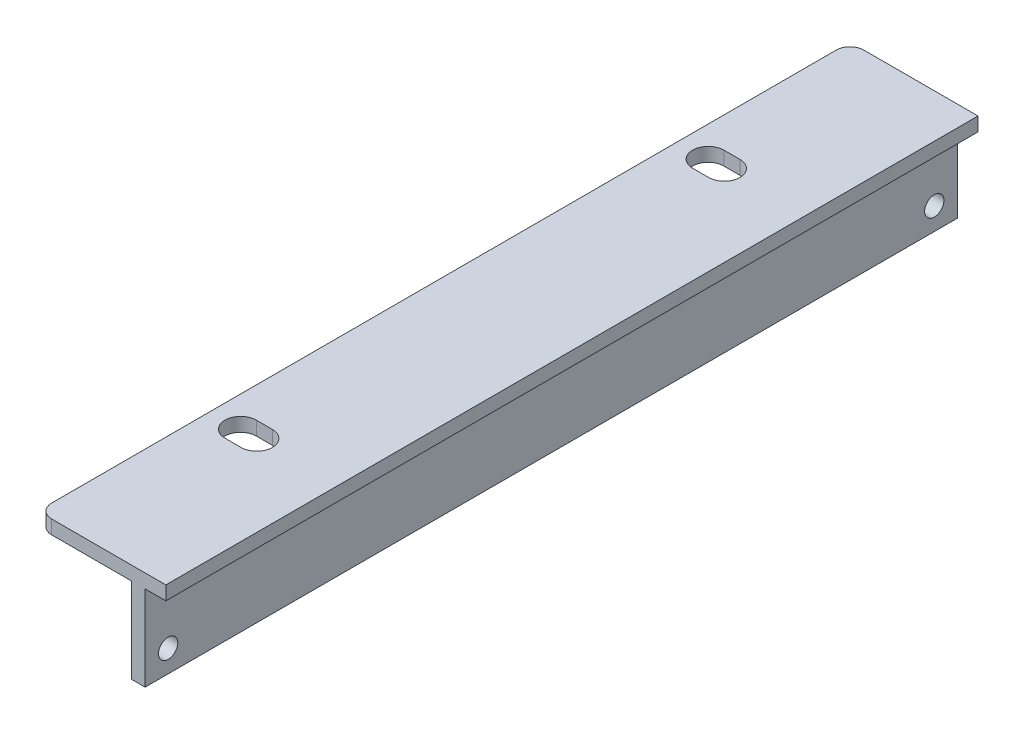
ISO-10303-21;
HEADER;
FILE_DESCRIPTION(('STEP AP214'),'2;1');
FILE_NAME('part.step','',(''),(''),'','','');
FILE_SCHEMA(('AUTOMOTIVE_DESIGN { 1 0 10303 214 1 1 1 1 }'));
ENDSEC;
DATA;
#1=APPLICATION_CONTEXT('core data for automotive mechanical design processes');
#2=APPLICATION_PROTOCOL_DEFINITION('international standard','automotive_design',2000,#1);
#3=PRODUCT_CONTEXT('',#1,'mechanical');
#4=PRODUCT('Part','Part','',(#3));
#5=PRODUCT_RELATED_PRODUCT_CATEGORY('part','',(#4));
#6=PRODUCT_DEFINITION_FORMATION('','',#4);
#7=PRODUCT_DEFINITION_CONTEXT('part definition',#1,'design');
#8=PRODUCT_DEFINITION('design','',#6,#7);
#9=PRODUCT_DEFINITION_SHAPE('','',#8);
#10=(LENGTH_UNIT() NAMED_UNIT(*) SI_UNIT(.MILLI.,.METRE.));
#11=(NAMED_UNIT(*) PLANE_ANGLE_UNIT() SI_UNIT($,.RADIAN.));
#12=(NAMED_UNIT(*) SI_UNIT($,.STERADIAN.) SOLID_ANGLE_UNIT());
#13=UNCERTAINTY_MEASURE_WITH_UNIT(LENGTH_MEASURE(1.E-05),#10,'distance_accuracy_value','');
#14=(GEOMETRIC_REPRESENTATION_CONTEXT(3) GLOBAL_UNCERTAINTY_ASSIGNED_CONTEXT((#13)) GLOBAL_UNIT_ASSIGNED_CONTEXT((#10,
#11,#12)) REPRESENTATION_CONTEXT('',''));
#15=CARTESIAN_POINT('',(0.,0.,0.));
#16=DIRECTION('',(0.,0.,1.));
#17=DIRECTION('',(1.,0.,0.));
#18=AXIS2_PLACEMENT_3D('',#15,#16,#17);
#19=CARTESIAN_POINT('',(-4.50000000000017,-2.99999999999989,-132.));
#20=DIRECTION('',(0.,-1.,0.));
#21=DIRECTION('',(0.,0.,-1.));
#22=AXIS2_PLACEMENT_3D('',#19,#20,#21);
#23=PLANE('',#22);
#24=DIRECTION('',(-1.,0.,0.));
#25=VECTOR('',#24,1.);
#26=CARTESIAN_POINT('',(-4.50000000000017,-2.99999999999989,0.));
#27=LINE('',#26,#25);
#28=CARTESIAN_POINT('',(0.,-2.99999999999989,0.));
#29=VERTEX_POINT('',#28);
#30=CARTESIAN_POINT('',(-4.50000000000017,-2.99999999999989,0.));
#31=VERTEX_POINT('',#30);
#32=EDGE_CURVE('E177',#29,#31,#27,.T.);
#33=ORIENTED_EDGE('',*,*,#32,.F.);
#34=DIRECTION('',(0.,0.,-1.));
#35=VECTOR('',#34,1.);
#36=CARTESIAN_POINT('',(0.,-2.99999999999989,-132.));
#37=LINE('',#36,#35);
#38=CARTESIAN_POINT('',(0.,-2.99999999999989,176.45));
#39=VERTEX_POINT('',#38);
#40=EDGE_CURVE('E175',#39,#29,#37,.T.);
#41=ORIENTED_EDGE('',*,*,#40,.F.);
#42=DIRECTION('',(1.,0.,0.));
#43=VECTOR('',#42,1.);
#44=CARTESIAN_POINT('',(-4.50000000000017,-2.99999999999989,176.45));
#45=LINE('',#44,#43);
#46=CARTESIAN_POINT('',(-4.50000000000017,-2.99999999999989,176.45));
#47=VERTEX_POINT('',#46);
#48=EDGE_CURVE('E313',#47,#39,#45,.T.);
#49=ORIENTED_EDGE('',*,*,#48,.F.);
#50=DIRECTION('',(0.,0.,-1.));
#51=VECTOR('',#50,1.);
#52=CARTESIAN_POINT('',(-4.50000000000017,-2.99999999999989,-132.));
#53=LINE('',#52,#51);
#54=EDGE_CURVE('E212',#31,#47,#53,.F.);
#55=ORIENTED_EDGE('',*,*,#54,.F.);
#56=EDGE_LOOP('',(#33,#41,#49,#55));
#57=FACE_BOUND('',#56,.T.);
#58=ADVANCED_FACE('F36',(#57),#23,.T.);
#59=CARTESIAN_POINT('',(-4.50000000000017,-2.99999999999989,-132.));
#60=DIRECTION('',(1.,0.,0.));
#61=DIRECTION('',(0.,0.,-1.));
#62=AXIS2_PLACEMENT_3D('',#59,#60,#61);
#63=PLANE('',#62);
#64=CARTESIAN_POINT('',(-4.50000000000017,-16.6699999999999,5.));
#65=DIRECTION('',(1.,0.,0.));
#66=DIRECTION('',(0.,0.,1.));
#67=AXIS2_PLACEMENT_3D('',#64,#65,#66);
#68=CIRCLE('',#67,2.09999999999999);
#69=CARTESIAN_POINT('',(-4.50000000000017,-16.6699999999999,7.09999999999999));
#70=VERTEX_POINT('',#69);
#71=EDGE_CURVE('E238',#70,#70,#68,.T.);
#72=ORIENTED_EDGE('',*,*,#71,.F.);
#73=EDGE_LOOP('',(#72));
#74=FACE_BOUND('',#73,.T.);
#75=CARTESIAN_POINT('',(-4.50000000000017,-16.6699999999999,171.45));
#76=DIRECTION('',(1.,0.,0.));
#77=DIRECTION('',(0.,0.,-1.));
#78=AXIS2_PLACEMENT_3D('',#75,#76,#77);
#79=CIRCLE('',#78,2.09999999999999);
#80=CARTESIAN_POINT('',(-4.50000000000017,-16.6699999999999,169.35));
#81=VERTEX_POINT('',#80);
#82=EDGE_CURVE('E227',#81,#81,#79,.T.);
#83=ORIENTED_EDGE('',*,*,#82,.F.);
#84=EDGE_LOOP('',(#83));
#85=FACE_BOUND('',#84,.T.);
#86=DIRECTION('',(0.,-1.,0.));
#87=VECTOR('',#86,1.);
#88=CARTESIAN_POINT('',(-4.50000000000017,-2.99999999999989,0.));
#89=LINE('',#88,#87);
#90=CARTESIAN_POINT('',(-4.50000000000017,-21.4999999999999,0.));
#91=VERTEX_POINT('',#90);
#92=EDGE_CURVE('E242',#31,#91,#89,.T.);
#93=ORIENTED_EDGE('',*,*,#92,.F.);
#94=ORIENTED_EDGE('',*,*,#54,.T.);
#95=DIRECTION('',(0.,1.,0.));
#96=VECTOR('',#95,1.);
#97=CARTESIAN_POINT('',(-4.50000000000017,-21.4999999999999,176.45));
#98=LINE('',#97,#96);
#99=CARTESIAN_POINT('',(-4.50000000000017,-21.4999999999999,176.45));
#100=VERTEX_POINT('',#99);
#101=EDGE_CURVE('E310',#100,#47,#98,.T.);
#102=ORIENTED_EDGE('',*,*,#101,.F.);
#103=DIRECTION('',(0.,0.,-1.));
#104=VECTOR('',#103,1.);
#105=CARTESIAN_POINT('',(-4.50000000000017,-21.4999999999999,-132.));
#106=LINE('',#105,#104);
#107=EDGE_CURVE('E210',#91,#100,#106,.F.);
#108=ORIENTED_EDGE('',*,*,#107,.F.);
#109=EDGE_LOOP('',(#93,#94,#102,#108));
#110=FACE_BOUND('',#109,.T.);
#111=ADVANCED_FACE('F373',(#74,#85,#110),#63,.T.);
#112=CARTESIAN_POINT('',(-7.50000000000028,-21.4999999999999,-132.));
#113=DIRECTION('',(0.,-1.,0.));
#114=DIRECTION('',(0.,0.,-1.));
#115=AXIS2_PLACEMENT_3D('',#112,#113,#114);
#116=PLANE('',#115);
#117=DIRECTION('',(-1.,0.,0.));
#118=VECTOR('',#117,1.);
#119=CARTESIAN_POINT('',(-7.50000000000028,-21.4999999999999,0.));
#120=LINE('',#119,#118);
#121=CARTESIAN_POINT('',(-7.50000000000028,-21.4999999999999,0.));
#122=VERTEX_POINT('',#121);
#123=EDGE_CURVE('E231',#91,#122,#120,.T.);
#124=ORIENTED_EDGE('',*,*,#123,.F.);
#125=ORIENTED_EDGE('',*,*,#107,.T.);
#126=DIRECTION('',(1.,0.,0.));
#127=VECTOR('',#126,1.);
#128=CARTESIAN_POINT('',(-7.50000000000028,-21.4999999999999,176.45));
#129=LINE('',#128,#127);
#130=CARTESIAN_POINT('',(-7.50000000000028,-21.4999999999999,176.45));
#131=VERTEX_POINT('',#130);
#132=EDGE_CURVE('E307',#131,#100,#129,.T.);
#133=ORIENTED_EDGE('',*,*,#132,.F.);
#134=DIRECTION('',(0.,0.,1.));
#135=VECTOR('',#134,1.);
#136=CARTESIAN_POINT('',(-7.50000000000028,-21.4999999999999,-132.));
#137=LINE('',#136,#135);
#138=EDGE_CURVE('E207',#122,#131,#137,.T.);
#139=ORIENTED_EDGE('',*,*,#138,.F.);
#140=EDGE_LOOP('',(#124,#125,#133,#139));
#141=FACE_BOUND('',#140,.T.);
#142=ADVANCED_FACE('F369',(#141),#116,.T.);
#143=CARTESIAN_POINT('',(-7.50000000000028,-2.99999999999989,-132.));
#144=DIRECTION('',(-1.,0.,0.));
#145=DIRECTION('',(0.,0.,1.));
#146=AXIS2_PLACEMENT_3D('',#143,#144,#145);
#147=PLANE('',#146);
#148=CARTESIAN_POINT('',(-7.50000000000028,-16.6699999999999,5.));
#149=DIRECTION('',(-1.,0.,0.));
#150=DIRECTION('',(0.,0.,1.));
#151=AXIS2_PLACEMENT_3D('',#148,#149,#150);
#152=CIRCLE('',#151,2.09999999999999);
#153=CARTESIAN_POINT('',(-7.50000000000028,-16.6699999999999,7.09999999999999));
#154=VERTEX_POINT('',#153);
#155=EDGE_CURVE('E40',#154,#154,#152,.T.);
#156=ORIENTED_EDGE('',*,*,#155,.F.);
#157=EDGE_LOOP('',(#156));
#158=FACE_BOUND('',#157,.T.);
#159=CARTESIAN_POINT('',(-7.50000000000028,-16.6699999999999,171.45));
#160=DIRECTION('',(-1.,0.,0.));
#161=DIRECTION('',(0.,0.,1.));
#162=AXIS2_PLACEMENT_3D('',#159,#160,#161);
#163=CIRCLE('',#162,2.09999999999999);
#164=CARTESIAN_POINT('',(-7.50000000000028,-16.6699999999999,173.55));
#165=VERTEX_POINT('',#164);
#166=EDGE_CURVE('E224',#165,#165,#163,.T.);
#167=ORIENTED_EDGE('',*,*,#166,.F.);
#168=EDGE_LOOP('',(#167));
#169=FACE_BOUND('',#168,.T.);
#170=DIRECTION('',(0.,1.,0.));
#171=VECTOR('',#170,1.);
#172=CARTESIAN_POINT('',(-7.50000000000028,-2.99999999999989,0.));
#173=LINE('',#172,#171);
#174=CARTESIAN_POINT('',(-7.50000000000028,-2.99999999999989,0.));
#175=VERTEX_POINT('',#174);
#176=EDGE_CURVE('E226',#122,#175,#173,.T.);
#177=ORIENTED_EDGE('',*,*,#176,.F.);
#178=ORIENTED_EDGE('',*,*,#138,.T.);
#179=DIRECTION('',(0.,-1.,0.));
#180=VECTOR('',#179,1.);
#181=CARTESIAN_POINT('',(-7.50000000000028,-2.99999999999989,176.45));
#182=LINE('',#181,#180);
#183=CARTESIAN_POINT('',(-7.50000000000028,-2.99999999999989,176.45));
#184=VERTEX_POINT('',#183);
#185=EDGE_CURVE('E304',#184,#131,#182,.T.);
#186=ORIENTED_EDGE('',*,*,#185,.F.);
#187=DIRECTION('',(0.,0.,-1.));
#188=VECTOR('',#187,1.);
#189=CARTESIAN_POINT('',(-7.50000000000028,-2.99999999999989,-132.));
#190=LINE('',#189,#188);
#191=EDGE_CURVE('E189',#175,#184,#190,.F.);
#192=ORIENTED_EDGE('',*,*,#191,.F.);
#193=EDGE_LOOP('',(#177,#178,#186,#192));
#194=FACE_BOUND('',#193,.T.);
#195=ADVANCED_FACE('F337',(#158,#169,#194),#147,.T.);
#196=CARTESIAN_POINT('',(-27.8,-2.99999999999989,-132.));
#197=DIRECTION('',(0.,-1.,0.));
#198=DIRECTION('',(0.,0.,-1.));
#199=AXIS2_PLACEMENT_3D('',#196,#197,#198);
#200=PLANE('',#199);
#201=DIRECTION('',(1.,0.,0.));
#202=VECTOR('',#201,1.);
#203=CARTESIAN_POINT('',(-27.8,-2.99999999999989,176.45));
#204=LINE('',#203,#202);
#205=CARTESIAN_POINT('',(-24.8,-2.99999999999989,176.45));
#206=VERTEX_POINT('',#205);
#207=EDGE_CURVE('E302',#206,#184,#204,.T.);
#208=ORIENTED_EDGE('',*,*,#207,.F.);
#209=CARTESIAN_POINT('',(-24.8,-2.99999999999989,173.45));
#210=DIRECTION('',(0.,-1.,0.));
#211=DIRECTION('',(0.,0.,-1.));
#212=AXIS2_PLACEMENT_3D('',#209,#210,#211);
#213=CIRCLE('',#212,3.);
#214=CARTESIAN_POINT('',(-27.8,-2.99999999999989,173.45));
#215=VERTEX_POINT('',#214);
#216=EDGE_CURVE('E216',#206,#215,#213,.T.);
#217=ORIENTED_EDGE('',*,*,#216,.T.);
#218=DIRECTION('',(0.,0.,-1.));
#219=VECTOR('',#218,1.);
#220=CARTESIAN_POINT('',(-27.8,-2.99999999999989,176.45));
#221=LINE('',#220,#219);
#222=CARTESIAN_POINT('',(-27.8,-2.99999999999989,3.));
#223=VERTEX_POINT('',#222);
#224=EDGE_CURVE('E317',#215,#223,#221,.T.);
#225=ORIENTED_EDGE('',*,*,#224,.T.);
#226=CARTESIAN_POINT('',(-24.8,-2.99999999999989,3.));
#227=DIRECTION('',(0.,-1.,0.));
#228=DIRECTION('',(0.,0.,-1.));
#229=AXIS2_PLACEMENT_3D('',#226,#227,#228);
#230=CIRCLE('',#229,3.);
#231=CARTESIAN_POINT('',(-24.8,-2.99999999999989,0.));
#232=VERTEX_POINT('',#231);
#233=EDGE_CURVE('E187',#223,#232,#230,.T.);
#234=ORIENTED_EDGE('',*,*,#233,.T.);
#235=DIRECTION('',(1.,0.,0.));
#236=VECTOR('',#235,1.);
#237=CARTESIAN_POINT('',(-24.8,-2.99999999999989,0.));
#238=LINE('',#237,#236);
#239=EDGE_CURVE('E166',#232,#175,#238,.T.);
#240=ORIENTED_EDGE('',*,*,#239,.T.);
#241=ORIENTED_EDGE('',*,*,#191,.T.);
#242=EDGE_LOOP('',(#208,#217,#225,#234,#240,#241));
#243=FACE_BOUND('',#242,.T.);
#244=CARTESIAN_POINT('',(-21.18,-2.99999999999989,139.025));
#245=DIRECTION('',(0.,-1.,0.));
#246=DIRECTION('',(0.,0.,-1.));
#247=AXIS2_PLACEMENT_3D('',#244,#245,#246);
#248=CIRCLE('',#247,3.39999999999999);
#249=CARTESIAN_POINT('',(-21.18,-2.99999999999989,142.425));
#250=VERTEX_POINT('',#249);
#251=CARTESIAN_POINT('',(-21.18,-2.99999999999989,135.625));
#252=VERTEX_POINT('',#251);
#253=EDGE_CURVE('E271',#250,#252,#248,.T.);
#254=ORIENTED_EDGE('',*,*,#253,.F.);
#255=DIRECTION('',(-1.,0.,0.));
#256=VECTOR('',#255,1.);
#257=CARTESIAN_POINT('',(-27.8,-2.99999999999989,142.425));
#258=LINE('',#257,#256);
#259=CARTESIAN_POINT('',(-17.68,-2.99999999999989,142.425));
#260=VERTEX_POINT('',#259);
#261=EDGE_CURVE('E258',#260,#250,#258,.T.);
#262=ORIENTED_EDGE('',*,*,#261,.F.);
#263=CARTESIAN_POINT('',(-17.68,-2.99999999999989,139.025));
#264=DIRECTION('',(0.,-1.,0.));
#265=DIRECTION('',(0.,0.,-1.));
#266=AXIS2_PLACEMENT_3D('',#263,#264,#265);
#267=CIRCLE('',#266,3.39999999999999);
#268=CARTESIAN_POINT('',(-17.68,-2.99999999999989,135.625));
#269=VERTEX_POINT('',#268);
#270=EDGE_CURVE('E266',#269,#260,#267,.T.);
#271=ORIENTED_EDGE('',*,*,#270,.F.);
#272=DIRECTION('',(1.,0.,0.));
#273=VECTOR('',#272,1.);
#274=CARTESIAN_POINT('',(-27.8,-2.99999999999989,135.625));
#275=LINE('',#274,#273);
#276=EDGE_CURVE('E269',#252,#269,#275,.T.);
#277=ORIENTED_EDGE('',*,*,#276,.F.);
#278=EDGE_LOOP('',(#254,#262,#271,#277));
#279=FACE_BOUND('',#278,.T.);
#280=CARTESIAN_POINT('',(-21.18,-2.99999999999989,37.425));
#281=DIRECTION('',(0.,-1.,0.));
#282=DIRECTION('',(0.,0.,-1.));
#283=AXIS2_PLACEMENT_3D('',#280,#281,#282);
#284=CIRCLE('',#283,3.4);
#285=CARTESIAN_POINT('',(-21.18,-2.99999999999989,40.825));
#286=VERTEX_POINT('',#285);
#287=CARTESIAN_POINT('',(-21.18,-2.99999999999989,34.025));
#288=VERTEX_POINT('',#287);
#289=EDGE_CURVE('E167',#286,#288,#284,.T.);
#290=ORIENTED_EDGE('',*,*,#289,.F.);
#291=DIRECTION('',(-1.,0.,0.));
#292=VECTOR('',#291,1.);
#293=CARTESIAN_POINT('',(-27.8,-2.99999999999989,40.825));
#294=LINE('',#293,#292);
#295=CARTESIAN_POINT('',(-17.68,-2.99999999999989,40.825));
#296=VERTEX_POINT('',#295);
#297=EDGE_CURVE('E287',#296,#286,#294,.T.);
#298=ORIENTED_EDGE('',*,*,#297,.F.);
#299=CARTESIAN_POINT('',(-17.68,-2.99999999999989,37.425));
#300=DIRECTION('',(0.,-1.,0.));
#301=DIRECTION('',(0.,0.,-1.));
#302=AXIS2_PLACEMENT_3D('',#299,#300,#301);
#303=CIRCLE('',#302,3.4);
#304=CARTESIAN_POINT('',(-17.68,-2.99999999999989,34.025));
#305=VERTEX_POINT('',#304);
#306=EDGE_CURVE('E295',#305,#296,#303,.T.);
#307=ORIENTED_EDGE('',*,*,#306,.F.);
#308=DIRECTION('',(1.,0.,0.));
#309=VECTOR('',#308,1.);
#310=CARTESIAN_POINT('',(-27.8,-2.99999999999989,34.025));
#311=LINE('',#310,#309);
#312=EDGE_CURVE('E298',#288,#305,#311,.T.);
#313=ORIENTED_EDGE('',*,*,#312,.F.);
#314=EDGE_LOOP('',(#290,#298,#307,#313));
#315=FACE_BOUND('',#314,.T.);
#316=ADVANCED_FACE('F329',(#243,#279,#315),#200,.T.);
#317=CARTESIAN_POINT('',(0.,0.,-132.));
#318=DIRECTION('',(1.,0.,0.));
#319=DIRECTION('',(0.,0.,-1.));
#320=AXIS2_PLACEMENT_3D('',#317,#318,#319);
#321=PLANE('',#320);
#322=DIRECTION('',(0.,-1.,0.));
#323=VECTOR('',#322,1.);
#324=CARTESIAN_POINT('',(0.,0.,0.));
#325=LINE('',#324,#323);
#326=CARTESIAN_POINT('',(0.,0.,0.));
#327=VERTEX_POINT('',#326);
#328=EDGE_CURVE('E163',#327,#29,#325,.T.);
#329=ORIENTED_EDGE('',*,*,#328,.F.);
#330=DIRECTION('',(0.,0.,1.));
#331=VECTOR('',#330,1.);
#332=CARTESIAN_POINT('',(0.,0.,-132.));
#333=LINE('',#332,#331);
#334=CARTESIAN_POINT('',(0.,0.,176.45));
#335=VERTEX_POINT('',#334);
#336=EDGE_CURVE('E173',#335,#327,#333,.F.);
#337=ORIENTED_EDGE('',*,*,#336,.F.);
#338=DIRECTION('',(0.,1.,0.));
#339=VECTOR('',#338,1.);
#340=CARTESIAN_POINT('',(0.,-2.99999999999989,176.45));
#341=LINE('',#340,#339);
#342=EDGE_CURVE('E316',#39,#335,#341,.T.);
#343=ORIENTED_EDGE('',*,*,#342,.F.);
#344=ORIENTED_EDGE('',*,*,#40,.T.);
#345=EDGE_LOOP('',(#329,#337,#343,#344));
#346=FACE_BOUND('',#345,.T.);
#347=ADVANCED_FACE('F171',(#346),#321,.T.);
#348=CARTESIAN_POINT('',(-27.8,0.,-132.));
#349=DIRECTION('',(0.,1.,0.));
#350=DIRECTION('',(0.,0.,1.));
#351=AXIS2_PLACEMENT_3D('',#348,#349,#350);
#352=PLANE('',#351);
#353=DIRECTION('',(0.,0.,-1.));
#354=VECTOR('',#353,1.);
#355=CARTESIAN_POINT('',(-27.8,0.,176.45));
#356=LINE('',#355,#354);
#357=CARTESIAN_POINT('',(-27.8,0.,173.45));
#358=VERTEX_POINT('',#357);
#359=CARTESIAN_POINT('',(-27.8,0.,3.));
#360=VERTEX_POINT('',#359);
#361=EDGE_CURVE('E193',#358,#360,#356,.T.);
#362=ORIENTED_EDGE('',*,*,#361,.F.);
#363=CARTESIAN_POINT('',(-24.8,0.,173.45));
#364=DIRECTION('',(0.,1.,0.));
#365=DIRECTION('',(0.,0.,1.));
#366=AXIS2_PLACEMENT_3D('',#363,#364,#365);
#367=CIRCLE('',#366,3.);
#368=CARTESIAN_POINT('',(-24.8,0.,176.45));
#369=VERTEX_POINT('',#368);
#370=EDGE_CURVE('E45',#358,#369,#367,.T.);
#371=ORIENTED_EDGE('',*,*,#370,.T.);
#372=DIRECTION('',(-1.,0.,0.));
#373=VECTOR('',#372,1.);
#374=CARTESIAN_POINT('',(0.,0.,176.45));
#375=LINE('',#374,#373);
#376=EDGE_CURVE('E183',#335,#369,#375,.T.);
#377=ORIENTED_EDGE('',*,*,#376,.F.);
#378=ORIENTED_EDGE('',*,*,#336,.T.);
#379=DIRECTION('',(-1.,0.,0.));
#380=VECTOR('',#379,1.);
#381=CARTESIAN_POINT('',(-24.8,0.,0.));
#382=LINE('',#381,#380);
#383=CARTESIAN_POINT('',(-24.8,0.,0.));
#384=VERTEX_POINT('',#383);
#385=EDGE_CURVE('E160',#327,#384,#382,.T.);
#386=ORIENTED_EDGE('',*,*,#385,.T.);
#387=CARTESIAN_POINT('',(-24.8,0.,3.));
#388=DIRECTION('',(0.,1.,0.));
#389=DIRECTION('',(0.,0.,1.));
#390=AXIS2_PLACEMENT_3D('',#387,#388,#389);
#391=CIRCLE('',#390,3.);
#392=EDGE_CURVE('E58',#384,#360,#391,.T.);
#393=ORIENTED_EDGE('',*,*,#392,.T.);
#394=EDGE_LOOP('',(#362,#371,#377,#378,#386,#393));
#395=FACE_BOUND('',#394,.T.);
#396=CARTESIAN_POINT('',(-21.18,0.,139.025));
#397=DIRECTION('',(0.,1.,0.));
#398=DIRECTION('',(0.,0.,1.));
#399=AXIS2_PLACEMENT_3D('',#396,#397,#398);
#400=CIRCLE('',#399,3.39999999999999);
#401=CARTESIAN_POINT('',(-21.18,0.,135.625));
#402=VERTEX_POINT('',#401);
#403=CARTESIAN_POINT('',(-21.18,0.,142.425));
#404=VERTEX_POINT('',#403);
#405=EDGE_CURVE('E176',#402,#404,#400,.T.);
#406=ORIENTED_EDGE('',*,*,#405,.F.);
#407=DIRECTION('',(-1.,0.,0.));
#408=VECTOR('',#407,1.);
#409=CARTESIAN_POINT('',(-21.18,0.,135.625));
#410=LINE('',#409,#408);
#411=CARTESIAN_POINT('',(-17.68,0.,135.625));
#412=VERTEX_POINT('',#411);
#413=EDGE_CURVE('E252',#412,#402,#410,.T.);
#414=ORIENTED_EDGE('',*,*,#413,.F.);
#415=CARTESIAN_POINT('',(-17.68,0.,139.025));
#416=DIRECTION('',(0.,1.,0.));
#417=DIRECTION('',(0.,0.,1.));
#418=AXIS2_PLACEMENT_3D('',#415,#416,#417);
#419=CIRCLE('',#418,3.39999999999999);
#420=CARTESIAN_POINT('',(-17.68,0.,142.425));
#421=VERTEX_POINT('',#420);
#422=EDGE_CURVE('E249',#421,#412,#419,.T.);
#423=ORIENTED_EDGE('',*,*,#422,.F.);
#424=DIRECTION('',(1.,0.,0.));
#425=VECTOR('',#424,1.);
#426=CARTESIAN_POINT('',(-21.18,0.,142.425));
#427=LINE('',#426,#425);
#428=EDGE_CURVE('E246',#404,#421,#427,.T.);
#429=ORIENTED_EDGE('',*,*,#428,.F.);
#430=EDGE_LOOP('',(#406,#414,#423,#429));
#431=FACE_BOUND('',#430,.T.);
#432=CARTESIAN_POINT('',(-21.18,0.,37.425));
#433=DIRECTION('',(0.,1.,0.));
#434=DIRECTION('',(0.,0.,1.));
#435=AXIS2_PLACEMENT_3D('',#432,#433,#434);
#436=CIRCLE('',#435,3.4);
#437=CARTESIAN_POINT('',(-21.18,0.,34.025));
#438=VERTEX_POINT('',#437);
#439=CARTESIAN_POINT('',(-21.18,0.,40.825));
#440=VERTEX_POINT('',#439);
#441=EDGE_CURVE('E273',#438,#440,#436,.T.);
#442=ORIENTED_EDGE('',*,*,#441,.F.);
#443=DIRECTION('',(-1.,0.,0.));
#444=VECTOR('',#443,1.);
#445=CARTESIAN_POINT('',(-21.18,0.,34.025));
#446=LINE('',#445,#444);
#447=CARTESIAN_POINT('',(-17.68,0.,34.025));
#448=VERTEX_POINT('',#447);
#449=EDGE_CURVE('E281',#448,#438,#446,.T.);
#450=ORIENTED_EDGE('',*,*,#449,.F.);
#451=CARTESIAN_POINT('',(-17.68,0.,37.425));
#452=DIRECTION('',(0.,1.,0.));
#453=DIRECTION('',(0.,0.,1.));
#454=AXIS2_PLACEMENT_3D('',#451,#452,#453);
#455=CIRCLE('',#454,3.4);
#456=CARTESIAN_POINT('',(-17.68,0.,40.825));
#457=VERTEX_POINT('',#456);
#458=EDGE_CURVE('E278',#457,#448,#455,.T.);
#459=ORIENTED_EDGE('',*,*,#458,.F.);
#460=DIRECTION('',(1.,0.,0.));
#461=VECTOR('',#460,1.);
#462=CARTESIAN_POINT('',(-21.18,0.,40.825));
#463=LINE('',#462,#461);
#464=EDGE_CURVE('E275',#440,#457,#463,.T.);
#465=ORIENTED_EDGE('',*,*,#464,.F.);
#466=EDGE_LOOP('',(#442,#450,#459,#465));
#467=FACE_BOUND('',#466,.T.);
#468=ADVANCED_FACE('F180',(#395,#431,#467),#352,.T.);
#469=CARTESIAN_POINT('',(0.,0.,0.));
#470=DIRECTION('',(0.,0.,1.));
#471=DIRECTION('',(1.,0.,0.));
#472=AXIS2_PLACEMENT_3D('',#469,#470,#471);
#473=PLANE('',#472);
#474=ORIENTED_EDGE('',*,*,#239,.F.);
#475=DIRECTION('',(0.,-1.,0.));
#476=VECTOR('',#475,1.);
#477=CARTESIAN_POINT('',(-24.8,0.,0.));
#478=LINE('',#477,#476);
#479=EDGE_CURVE('E11',#232,#384,#478,.F.);
#480=ORIENTED_EDGE('',*,*,#479,.T.);
#481=ORIENTED_EDGE('',*,*,#385,.F.);
#482=ORIENTED_EDGE('',*,*,#328,.T.);
#483=ORIENTED_EDGE('',*,*,#32,.T.);
#484=ORIENTED_EDGE('',*,*,#92,.T.);
#485=ORIENTED_EDGE('',*,*,#123,.T.);
#486=ORIENTED_EDGE('',*,*,#176,.T.);
#487=EDGE_LOOP('',(#474,#480,#481,#482,#483,#484,#485,#486));
#488=FACE_BOUND('',#487,.T.);
#489=ADVANCED_FACE('F162',(#488),#473,.F.);
#490=CARTESIAN_POINT('',(-27.8,0.,176.45));
#491=DIRECTION('',(1.,0.,0.));
#492=DIRECTION('',(0.,0.,-1.));
#493=AXIS2_PLACEMENT_3D('',#490,#491,#492);
#494=PLANE('',#493);
#495=ORIENTED_EDGE('',*,*,#224,.F.);
#496=DIRECTION('',(0.,-1.,0.));
#497=VECTOR('',#496,1.);
#498=CARTESIAN_POINT('',(-27.8,0.,173.45));
#499=LINE('',#498,#497);
#500=EDGE_CURVE('E221',#215,#358,#499,.F.);
#501=ORIENTED_EDGE('',*,*,#500,.T.);
#502=ORIENTED_EDGE('',*,*,#361,.T.);
#503=DIRECTION('',(0.,-1.,0.));
#504=VECTOR('',#503,1.);
#505=CARTESIAN_POINT('',(-27.8,0.,3.));
#506=LINE('',#505,#504);
#507=EDGE_CURVE('E218',#360,#223,#506,.T.);
#508=ORIENTED_EDGE('',*,*,#507,.T.);
#509=EDGE_LOOP('',(#495,#501,#502,#508));
#510=FACE_BOUND('',#509,.T.);
#511=ADVANCED_FACE('F324',(#510),#494,.F.);
#512=CARTESIAN_POINT('',(0.,0.,176.45));
#513=DIRECTION('',(0.,0.,1.));
#514=DIRECTION('',(1.,0.,0.));
#515=AXIS2_PLACEMENT_3D('',#512,#513,#514);
#516=PLANE('',#515);
#517=ORIENTED_EDGE('',*,*,#376,.T.);
#518=DIRECTION('',(0.,-1.,0.));
#519=VECTOR('',#518,1.);
#520=CARTESIAN_POINT('',(-24.8,-2.99999999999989,176.45));
#521=LINE('',#520,#519);
#522=EDGE_CURVE('E184',#369,#206,#521,.T.);
#523=ORIENTED_EDGE('',*,*,#522,.T.);
#524=ORIENTED_EDGE('',*,*,#207,.T.);
#525=ORIENTED_EDGE('',*,*,#185,.T.);
#526=ORIENTED_EDGE('',*,*,#132,.T.);
#527=ORIENTED_EDGE('',*,*,#101,.T.);
#528=ORIENTED_EDGE('',*,*,#48,.T.);
#529=ORIENTED_EDGE('',*,*,#342,.T.);
#530=EDGE_LOOP('',(#517,#523,#524,#525,#526,#527,#528,#529));
#531=FACE_BOUND('',#530,.T.);
#532=ADVANCED_FACE('F339',(#531),#516,.T.);
#533=CARTESIAN_POINT('',(-21.18,-176.45,37.425));
#534=DIRECTION('',(0.,1.,0.));
#535=DIRECTION('',(0.,0.,1.));
#536=AXIS2_PLACEMENT_3D('',#533,#534,#535);
#537=CYLINDRICAL_SURFACE('',#536,3.4);
#538=ORIENTED_EDGE('',*,*,#289,.T.);
#539=DIRECTION('',(0.,1.,0.));
#540=VECTOR('',#539,1.);
#541=CARTESIAN_POINT('',(-21.18,-176.45,34.025));
#542=LINE('',#541,#540);
#543=EDGE_CURVE('E285',#288,#438,#542,.T.);
#544=ORIENTED_EDGE('',*,*,#543,.T.);
#545=ORIENTED_EDGE('',*,*,#441,.T.);
#546=DIRECTION('',(0.,1.,0.));
#547=VECTOR('',#546,1.);
#548=CARTESIAN_POINT('',(-21.18,-176.45,40.825));
#549=LINE('',#548,#547);
#550=EDGE_CURVE('E284',#286,#440,#549,.T.);
#551=ORIENTED_EDGE('',*,*,#550,.F.);
#552=EDGE_LOOP('',(#538,#544,#545,#551));
#553=FACE_BOUND('',#552,.T.);
#554=ADVANCED_FACE('F454',(#553),#537,.F.);
#555=CARTESIAN_POINT('',(-21.18,-176.45,34.025));
#556=DIRECTION('',(0.,0.,-1.));
#557=DIRECTION('',(-1.,0.,0.));
#558=AXIS2_PLACEMENT_3D('',#555,#556,#557);
#559=PLANE('',#558);
#560=ORIENTED_EDGE('',*,*,#312,.T.);
#561=DIRECTION('',(0.,1.,0.));
#562=VECTOR('',#561,1.);
#563=CARTESIAN_POINT('',(-17.68,-176.45,34.025));
#564=LINE('',#563,#562);
#565=EDGE_CURVE('E288',#305,#448,#564,.T.);
#566=ORIENTED_EDGE('',*,*,#565,.T.);
#567=ORIENTED_EDGE('',*,*,#449,.T.);
#568=ORIENTED_EDGE('',*,*,#543,.F.);
#569=EDGE_LOOP('',(#560,#566,#567,#568));
#570=FACE_BOUND('',#569,.T.);
#571=ADVANCED_FACE('F462',(#570),#559,.F.);
#572=CARTESIAN_POINT('',(-17.68,-176.45,37.425));
#573=DIRECTION('',(0.,1.,0.));
#574=DIRECTION('',(0.,0.,1.));
#575=AXIS2_PLACEMENT_3D('',#572,#573,#574);
#576=CYLINDRICAL_SURFACE('',#575,3.4);
#577=ORIENTED_EDGE('',*,*,#306,.T.);
#578=DIRECTION('',(0.,1.,0.));
#579=VECTOR('',#578,1.);
#580=CARTESIAN_POINT('',(-17.68,-176.45,40.825));
#581=LINE('',#580,#579);
#582=EDGE_CURVE('E290',#296,#457,#581,.T.);
#583=ORIENTED_EDGE('',*,*,#582,.T.);
#584=ORIENTED_EDGE('',*,*,#458,.T.);
#585=ORIENTED_EDGE('',*,*,#565,.F.);
#586=EDGE_LOOP('',(#577,#583,#584,#585));
#587=FACE_BOUND('',#586,.T.);
#588=ADVANCED_FACE('F471',(#587),#576,.F.);
#589=CARTESIAN_POINT('',(-21.18,-176.45,40.825));
#590=DIRECTION('',(0.,0.,1.));
#591=DIRECTION('',(1.,0.,0.));
#592=AXIS2_PLACEMENT_3D('',#589,#590,#591);
#593=PLANE('',#592);
#594=ORIENTED_EDGE('',*,*,#297,.T.);
#595=ORIENTED_EDGE('',*,*,#550,.T.);
#596=ORIENTED_EDGE('',*,*,#464,.T.);
#597=ORIENTED_EDGE('',*,*,#582,.F.);
#598=EDGE_LOOP('',(#594,#595,#596,#597));
#599=FACE_BOUND('',#598,.T.);
#600=ADVANCED_FACE('F480',(#599),#593,.F.);
#601=CARTESIAN_POINT('',(-21.18,-176.45,139.025));
#602=DIRECTION('',(0.,1.,0.));
#603=DIRECTION('',(0.,0.,1.));
#604=AXIS2_PLACEMENT_3D('',#601,#602,#603);
#605=CYLINDRICAL_SURFACE('',#604,3.39999999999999);
#606=ORIENTED_EDGE('',*,*,#253,.T.);
#607=DIRECTION('',(0.,1.,0.));
#608=VECTOR('',#607,1.);
#609=CARTESIAN_POINT('',(-21.18,-176.45,135.625));
#610=LINE('',#609,#608);
#611=EDGE_CURVE('E256',#252,#402,#610,.T.);
#612=ORIENTED_EDGE('',*,*,#611,.T.);
#613=ORIENTED_EDGE('',*,*,#405,.T.);
#614=DIRECTION('',(0.,1.,0.));
#615=VECTOR('',#614,1.);
#616=CARTESIAN_POINT('',(-21.18,-176.45,142.425));
#617=LINE('',#616,#615);
#618=EDGE_CURVE('E255',#250,#404,#617,.T.);
#619=ORIENTED_EDGE('',*,*,#618,.F.);
#620=EDGE_LOOP('',(#606,#612,#613,#619));
#621=FACE_BOUND('',#620,.T.);
#622=ADVANCED_FACE('F489',(#621),#605,.F.);
#623=CARTESIAN_POINT('',(-21.18,-176.45,135.625));
#624=DIRECTION('',(0.,0.,-1.));
#625=DIRECTION('',(-1.,0.,0.));
#626=AXIS2_PLACEMENT_3D('',#623,#624,#625);
#627=PLANE('',#626);
#628=ORIENTED_EDGE('',*,*,#276,.T.);
#629=DIRECTION('',(0.,1.,0.));
#630=VECTOR('',#629,1.);
#631=CARTESIAN_POINT('',(-17.68,-176.45,135.625));
#632=LINE('',#631,#630);
#633=EDGE_CURVE('E259',#269,#412,#632,.T.);
#634=ORIENTED_EDGE('',*,*,#633,.T.);
#635=ORIENTED_EDGE('',*,*,#413,.T.);
#636=ORIENTED_EDGE('',*,*,#611,.F.);
#637=EDGE_LOOP('',(#628,#634,#635,#636));
#638=FACE_BOUND('',#637,.T.);
#639=ADVANCED_FACE('F498',(#638),#627,.F.);
#640=CARTESIAN_POINT('',(-17.68,-176.45,139.025));
#641=DIRECTION('',(0.,1.,0.));
#642=DIRECTION('',(0.,0.,1.));
#643=AXIS2_PLACEMENT_3D('',#640,#641,#642);
#644=CYLINDRICAL_SURFACE('',#643,3.39999999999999);
#645=ORIENTED_EDGE('',*,*,#270,.T.);
#646=DIRECTION('',(0.,1.,0.));
#647=VECTOR('',#646,1.);
#648=CARTESIAN_POINT('',(-17.68,-176.45,142.425));
#649=LINE('',#648,#647);
#650=EDGE_CURVE('E261',#260,#421,#649,.T.);
#651=ORIENTED_EDGE('',*,*,#650,.T.);
#652=ORIENTED_EDGE('',*,*,#422,.T.);
#653=ORIENTED_EDGE('',*,*,#633,.F.);
#654=EDGE_LOOP('',(#645,#651,#652,#653));
#655=FACE_BOUND('',#654,.T.);
#656=ADVANCED_FACE('F351',(#655),#644,.F.);
#657=CARTESIAN_POINT('',(-21.18,-176.45,142.425));
#658=DIRECTION('',(0.,0.,1.));
#659=DIRECTION('',(1.,0.,0.));
#660=AXIS2_PLACEMENT_3D('',#657,#658,#659);
#661=PLANE('',#660);
#662=ORIENTED_EDGE('',*,*,#261,.T.);
#663=ORIENTED_EDGE('',*,*,#618,.T.);
#664=ORIENTED_EDGE('',*,*,#428,.T.);
#665=ORIENTED_EDGE('',*,*,#650,.F.);
#666=EDGE_LOOP('',(#662,#663,#664,#665));
#667=FACE_BOUND('',#666,.T.);
#668=ADVANCED_FACE('F345',(#667),#661,.F.);
#669=CARTESIAN_POINT('',(-24.8,0.,173.45));
#670=DIRECTION('',(0.,1.,0.));
#671=DIRECTION('',(0.,0.,1.));
#672=AXIS2_PLACEMENT_3D('',#669,#670,#671);
#673=CYLINDRICAL_SURFACE('',#672,3.);
#674=ORIENTED_EDGE('',*,*,#370,.F.);
#675=ORIENTED_EDGE('',*,*,#500,.F.);
#676=ORIENTED_EDGE('',*,*,#216,.F.);
#677=ORIENTED_EDGE('',*,*,#522,.F.);
#678=EDGE_LOOP('',(#674,#675,#676,#677));
#679=FACE_BOUND('',#678,.T.);
#680=ADVANCED_FACE('F343',(#679),#673,.T.);
#681=CARTESIAN_POINT('',(-24.8,0.,3.));
#682=DIRECTION('',(0.,-1.,0.));
#683=DIRECTION('',(0.,0.,-1.));
#684=AXIS2_PLACEMENT_3D('',#681,#682,#683);
#685=CYLINDRICAL_SURFACE('',#684,3.);
#686=ORIENTED_EDGE('',*,*,#392,.F.);
#687=ORIENTED_EDGE('',*,*,#479,.F.);
#688=ORIENTED_EDGE('',*,*,#233,.F.);
#689=ORIENTED_EDGE('',*,*,#507,.F.);
#690=EDGE_LOOP('',(#686,#687,#688,#689));
#691=FACE_BOUND('',#690,.T.);
#692=ADVANCED_FACE('F38',(#691),#685,.T.);
#693=CARTESIAN_POINT('',(-27.8,-16.6699999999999,171.45));
#694=DIRECTION('',(1.,0.,0.));
#695=DIRECTION('',(0.,0.,-1.));
#696=AXIS2_PLACEMENT_3D('',#693,#694,#695);
#697=CYLINDRICAL_SURFACE('',#696,2.09999999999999);
#698=ORIENTED_EDGE('',*,*,#166,.T.);
#699=EDGE_LOOP('',(#698));
#700=FACE_BOUND('',#699,.T.);
#701=ORIENTED_EDGE('',*,*,#82,.T.);
#702=EDGE_LOOP('',(#701));
#703=FACE_BOUND('',#702,.T.);
#704=ADVANCED_FACE('F350',(#700,#703),#697,.F.);
#705=CARTESIAN_POINT('',(-27.8,-16.6699999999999,5.));
#706=DIRECTION('',(1.,0.,0.));
#707=DIRECTION('',(0.,0.,-1.));
#708=AXIS2_PLACEMENT_3D('',#705,#706,#707);
#709=CYLINDRICAL_SURFACE('',#708,2.09999999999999);
#710=ORIENTED_EDGE('',*,*,#155,.T.);
#711=EDGE_LOOP('',(#710));
#712=FACE_BOUND('',#711,.T.);
#713=ORIENTED_EDGE('',*,*,#71,.T.);
#714=EDGE_LOOP('',(#713));
#715=FACE_BOUND('',#714,.T.);
#716=ADVANCED_FACE('F535',(#712,#715),#709,.F.);
#717=CLOSED_SHELL('',(#58,#111,#142,#195,#316,#347,#468,#489,#511,#532,#554,#571,#588,#600,#622,
#639,#656,#668,#680,#692,#704,#716));
#718=MANIFOLD_SOLID_BREP('B2',#717);
#719=ADVANCED_BREP_SHAPE_REPRESENTATION('',(#18,#718),#14);
#720=SHAPE_DEFINITION_REPRESENTATION(#9,#719);
ENDSEC;
END-ISO-10303-21;
